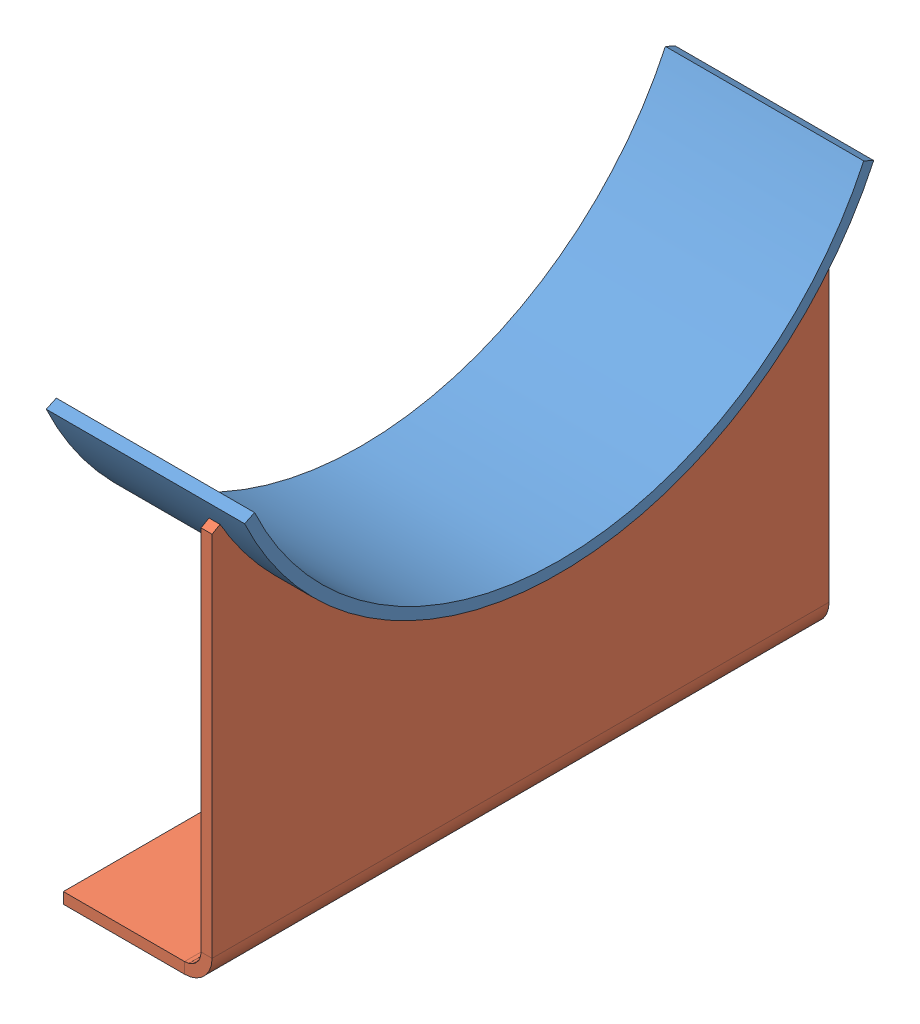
SolidWorks assembly Berceau.SLDASM, configuration Défaut (file format 4400). Lengths in mm.
Overall size (310.43 1032.89 570.97).
3 component instances, 3 part files, 0 mates.
Components (placement in the parent):
- Fourrure-1: Fourrure.sldprt [Défaut] at origin size (310.43 904.28 570.97)
- Jupe-1: Jupe.sldprt [Défaut] at (415 0 0) x (0 0 -1) z (1 0 0) size (560 362.5 135)
- Raidisseur du berceau-1: Raidisseur du berceau.sldprt [Défaut] at origin size (120 195.04 10)
